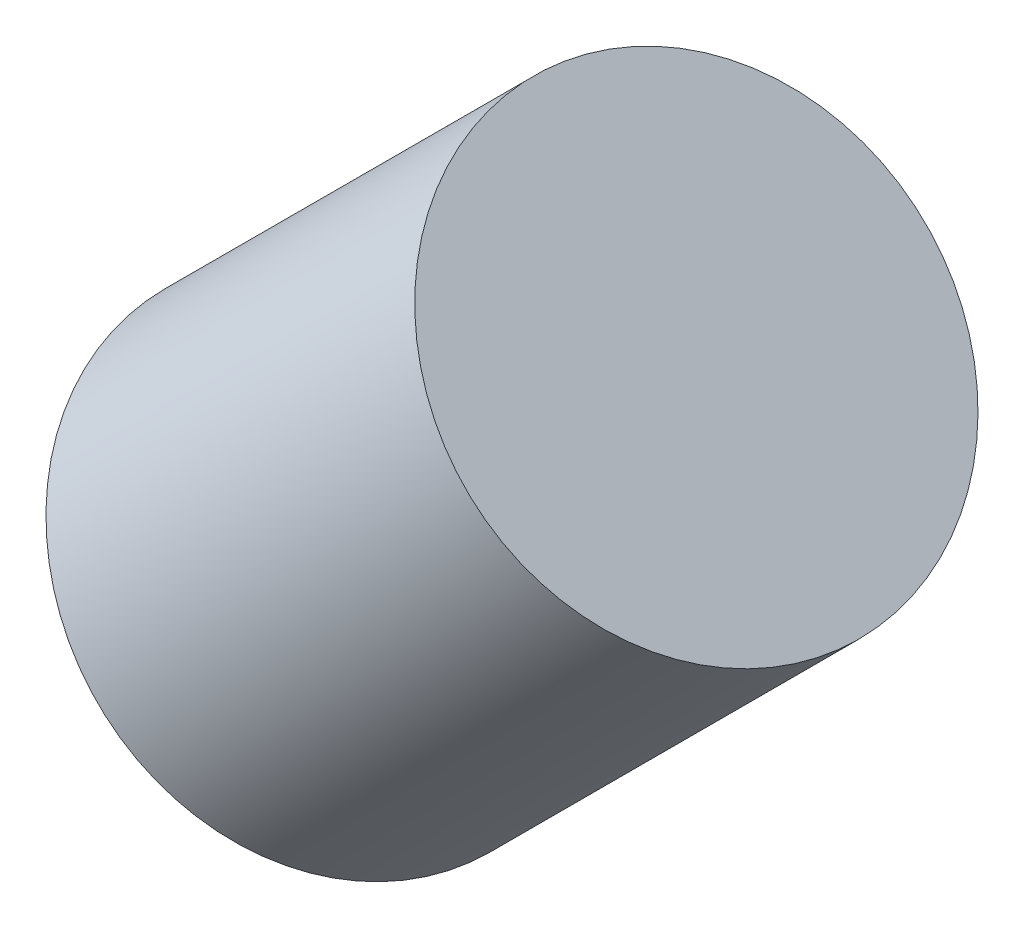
from build123d import *


with BuildPart() as part:
    # Sketch 1 → Revolve 1 (revolve)
    with BuildSketch(Plane.XY):
        Polygon((18.39952564, 29.242640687), (17.338865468, 30.303300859), (14.933342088, 27.897777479), (15.571098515, 26.414213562), align=None)
    revolve(axis=Axis((14.156884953, 25, 0), (0.7071067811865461, 0.7071067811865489, 0)))


solid = part.part
